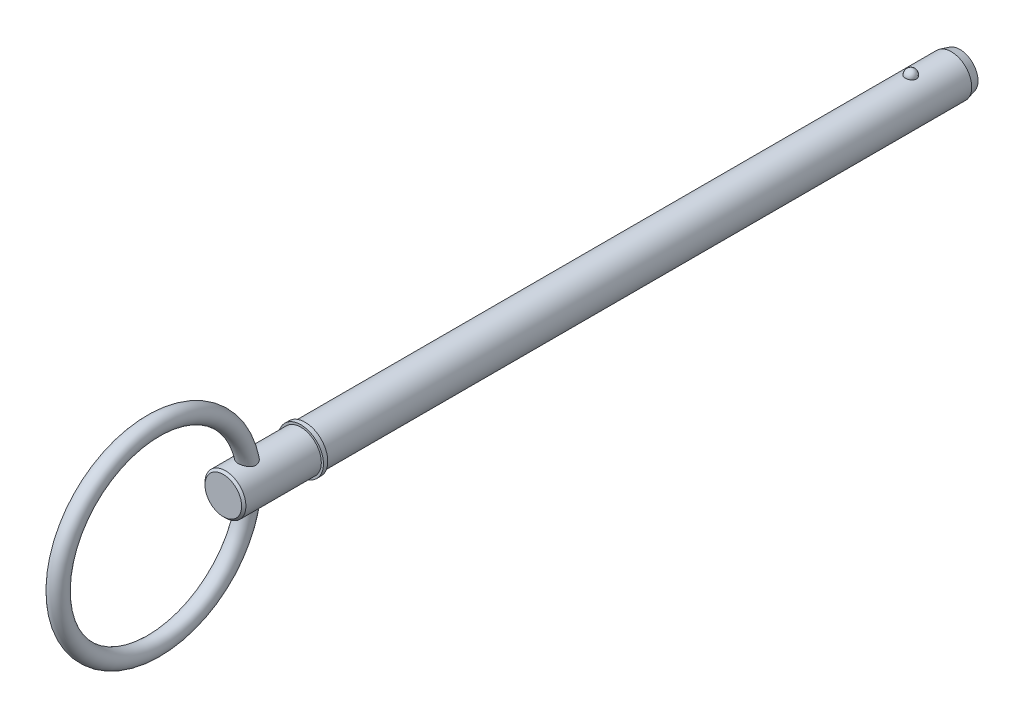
from build123d import *

# Parameters (mm, degrees)
SKETCH2_R           = 4.765
BOSS_EXTRUDE1_DEPTH = 139.7
BOSS_EXTRUDE2_START = 12.7
SKETCH3_R           = 4.765
BOSS_EXTRUDE2_DEPTH = 12.7
CHAMFER1_SIZE       = 2
CHAMFER1_SIZE2      = 0.535898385
SKETCH20_W          = 1
SKETCH20_H          = 5.265
SKETCH21_R          = 4.765
BOSS_EXTRUDE3_DEPTH = 19.05
CHAMFER2_SIZE       = 0.5
SKETCH24_R          = 2


with BuildPart() as part:
    # Sketch2 → Boss-Extrude1 (new body)
    with BuildSketch(Plane.XY):
        Circle(SKETCH2_R)
    extrude(amount=BOSS_EXTRUDE1_DEPTH)

    # Sketch3 → Boss-Extrude2 (add)
    with BuildSketch(Plane(origin=(0, 0, 0), x_dir=(-1, 0, 0), z_dir=(0, 0, -1)).offset(BOSS_EXTRUDE2_START)):
        Circle(SKETCH3_R)
    extrude(amount=-BOSS_EXTRUDE2_DEPTH)

    # Chamfer1
    chamfer1_edges = [part.edges().sort_by_distance(p)[0] for p in [
        (4.765, 0, -12.7),
    ]]
    chamfer1_side = [part.faces().sort_by_distance(p)[0] for p in [
        (4.765, 0, -6.35),
    ]]
    chamfer(chamfer1_edges, length=CHAMFER1_SIZE, length2=CHAMFER1_SIZE2, reference=chamfer1_side[0])

    # Sketch18 → Revolve1 (revolve)
    with BuildSketch(Plane(origin=(0, 0, 0), x_dir=(0, 0, -1), z_dir=(1, 0, 0))):
        with BuildLine():
            Line((1.29, 6.055), (1.29, 3.475))
            ThreePointArc((1.29, 3.475), (0, 4.765), (1.29, 6.055))
        make_face()
    revolve(axis=Axis((0, 6.055, -1.29), (0, -1, 0)))

    # Sketch20 → Revolve2 (revolve)
    with BuildSketch(Plane(origin=(0, 0, 0), x_dir=(0, 0, -1), z_dir=(1, 0, 0)), mode=Mode.PRIVATE) as revolve2_sk:
        with Locations((-140.2, 2.6325)):
            Rectangle(SKETCH20_W, SKETCH20_H)
    revolve(revolve2_sk.sketch.rotate(Axis((0, 0, 33.728787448), (0, 0, 1)), 90), axis=Axis((0, 0, 33.728787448), (0, 0, 1)))

    # Sketch21 → Boss-Extrude3 (add)
    with BuildSketch(Plane(origin=(0, 0, 139.7), x_dir=(-1, 0, 0), z_dir=(0, 0, -1))):
        Circle(SKETCH21_R)
    extrude(amount=-BOSS_EXTRUDE3_DEPTH)

    # Chamfer2
    chamfer2_edges = [part.edges().sort_by_distance(p)[0] for p in [
        (4.765, 0, 158.75),
    ]]
    chamfer(chamfer2_edges, length=CHAMFER2_SIZE)

    # Sweep1: sweep along a path in Sketch23
    with BuildLine(Plane(origin=(0, 0, 0), x_dir=(0, 0, -1), z_dir=(1, 0, 0))) as sweep1_path:
        CenterArc((-174.975, 0), 22.225, 0, 360)
    # Sketch24 → Sweep1 (sweep)
    with BuildSketch(Plane(origin=(0, 0, 0), x_dir=(1, 0, 0), z_dir=(0, 1, 0))):
        with Locations((0, -152.75)):
            Circle(SKETCH24_R)
    sweep(path=sweep1_path.line)


solid = part.part
